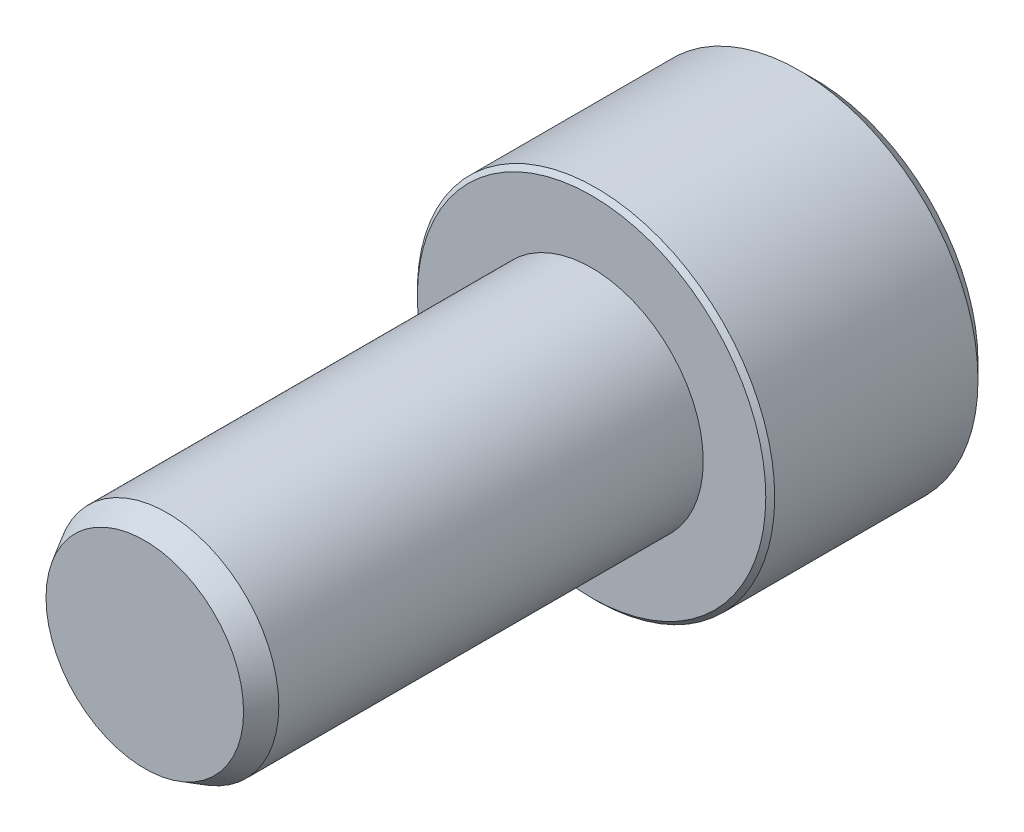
from build123d import *

# Parameters (mm, degrees)
ESQUISSE1_R             = 5
BASE_EXTRUSION_DEPTH    = 20
ESQUISSE2_R             = 8
BOSS_EXTRU_1_DEPTH      = 10
ENL_V_MAT_EXTRU_1_DEPTH = 5.5
CHANFREIN1_SIZE         = 0.7
CHANFREIN2_SIZE         = 1
CHANFREIN2_SIZE2        = 0.577350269
CHANFREIN3_SIZE         = 0.2


with BuildPart() as part:
    # Esquisse1 → Base-Extrusion (new body)
    with BuildSketch(Plane.XY):
        Circle(ESQUISSE1_R)
    extrude(amount=BASE_EXTRUSION_DEPTH)

    # Esquisse2 → Boss.-Extru.1 (add)
    with BuildSketch(Plane.XY):
        Circle(ESQUISSE2_R)
    extrude(amount=-BOSS_EXTRU_1_DEPTH)

    # Esquisse3 → Enl_v. mat.-Extru.1 (cut)
    with BuildSketch(Plane.XY.offset(-10)):
        Polygon((-2.309401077, 4), (2.309401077, 4), (4.618802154, 0), (2.309401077, -4), (-2.309401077, -4), (-4.618802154, 0), align=None)
    extrude(amount=ENL_V_MAT_EXTRU_1_DEPTH, mode=Mode.SUBTRACT)

    # Chanfrein1
    chanfrein1_edges = [part.edges().sort_by_distance(p)[0] for p in [
        (-8, 0, -10),
    ]]
    chamfer(chanfrein1_edges, length=CHANFREIN1_SIZE)

    # Chanfrein2
    chanfrein2_edges = [part.edges().sort_by_distance(p)[0] for p in [
        (-5, 0, 20),
    ]]
    chanfrein2_side = [part.faces().sort_by_distance(p)[0] for p in [
        (-5, 0, 10),
    ]]
    chamfer(chanfrein2_edges, length=CHANFREIN2_SIZE, length2=CHANFREIN2_SIZE2, reference=chanfrein2_side[0])

    # Chanfrein3
    chanfrein3_edges = [part.edges().sort_by_distance(p)[0] for p in [
        (-8, 0, 0),
    ]]
    chamfer(chanfrein3_edges, length=CHANFREIN3_SIZE)


solid = part.part
